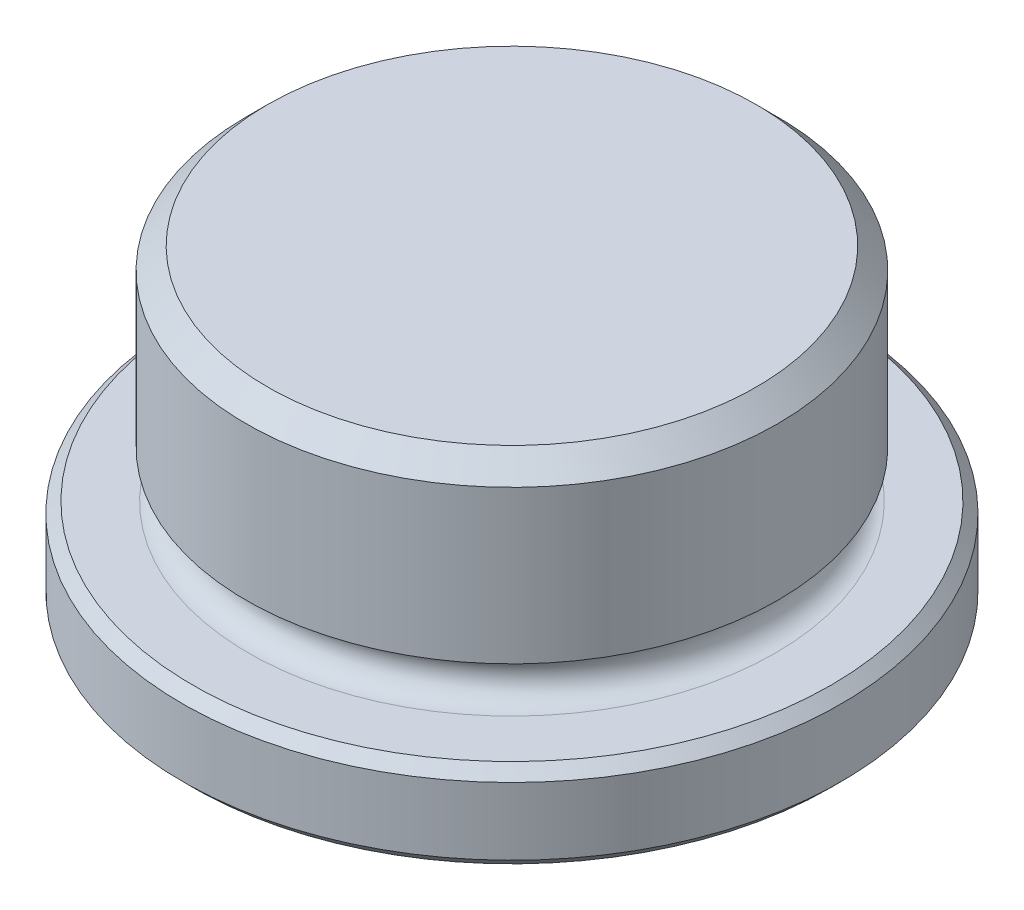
from build123d import *

# Parameters (mm, degrees)
CUT_EXTRUDE1_DEPTH = 7.874


with BuildPart() as part:
    # Sketch1 → Revolve1 (revolve)
    with BuildSketch(Plane.XY, mode=Mode.PRIVATE) as revolve1_sk:
        with BuildLine():
            Line((0, 0), (11.43, 0))
            Line((11.43, 0), (11.811, 0.381))
            Line((11.811, 0.381), (11.811, 2.794))
            Line((11.811, 2.794), (11.43, 3.175))
            Line((11.43, 3.175), (9.436, 3.175))
            ThreePointArc((9.436, 3.175), (8.648153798, 3.836081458), (9.162383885, 4.726754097))
            Line((9.162383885, 4.726754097), (9.525, 4.858735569))
            Line((9.525, 4.858735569), (9.525, 10.3378))
            Line((9.525, 10.3378), (8.763, 11.0998))
            Line((8.763, 11.0998), (0, 11.0998))
            Line((0, 11.0998), (0, 0))
        make_face()
    revolve(revolve1_sk.sketch.rotate(Axis((0, 11.0998, 0), (0, -1, 0)), 180), axis=Axis((0, 11.0998, 0), (0, -1, 0)))

    # Sketch2 → Cut-Extrude1 (cut)
    with BuildSketch(Plane.XZ):
        Polygon((-2.749630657, 4.7625), (-5.499261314, 0), (-2.749630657, -4.7625), (2.749630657, -4.7625), (5.499261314, 0), (2.749630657, 4.7625), align=None)
    extrude(amount=-CUT_EXTRUDE1_DEPTH, mode=Mode.SUBTRACT)

    # Sketch8 → Cut-Revolve1 (revolve, cut)
    with BuildSketch(Plane.XY, mode=Mode.PRIVATE) as cut_revolve1_sk:
        Polygon((-5.753261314, 0), (-2.049798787, 3.703462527), (0, 3.703462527), (0, 0), align=None)
    revolve(cut_revolve1_sk.sketch.rotate(Axis((0, 3.703462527, 0), (0, -1, 0)), 59.9999999), axis=Axis((0, 3.703462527, 0), (0, -1, 0)), mode=Mode.SUBTRACT)


solid = part.part
